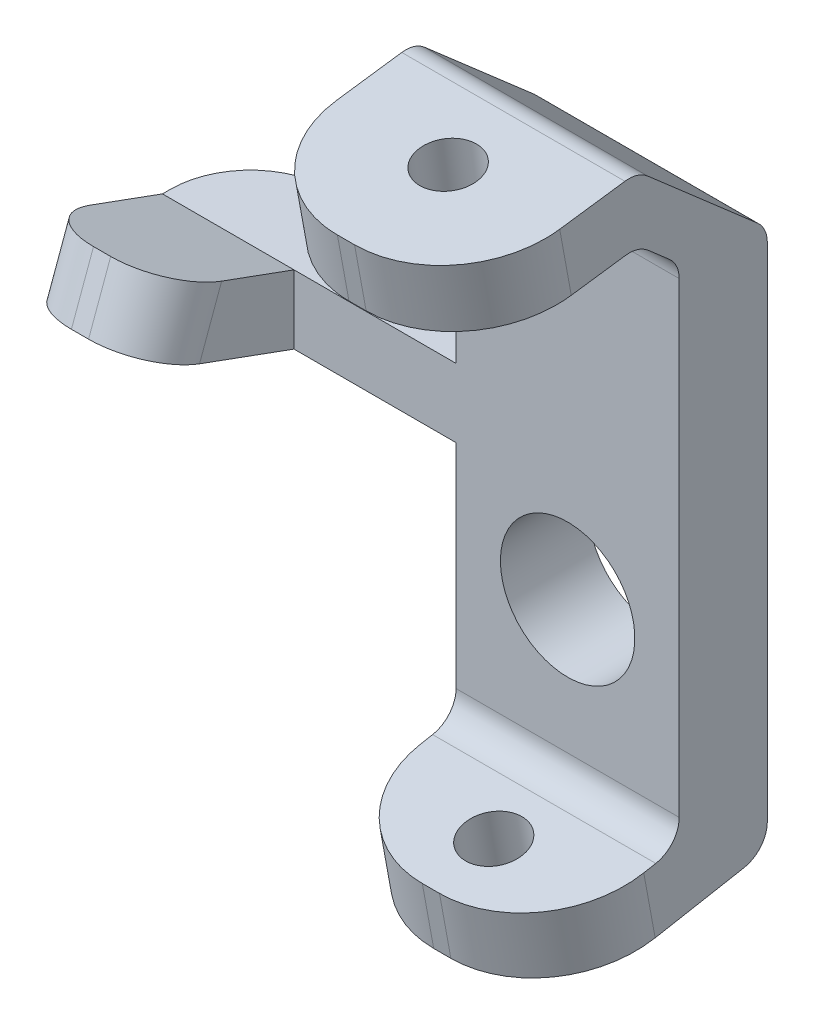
ISO-10303-21;
HEADER;
FILE_DESCRIPTION(('STEP AP214'),'2;1');
FILE_NAME('part.step','',(''),(''),'','','');
FILE_SCHEMA(('AUTOMOTIVE_DESIGN { 1 0 10303 214 1 1 1 1 }'));
ENDSEC;
DATA;
#1=APPLICATION_CONTEXT('core data for automotive mechanical design processes');
#2=APPLICATION_PROTOCOL_DEFINITION('international standard','automotive_design',2000,#1);
#3=PRODUCT_CONTEXT('',#1,'mechanical');
#4=PRODUCT('Part','Part','',(#3));
#5=PRODUCT_RELATED_PRODUCT_CATEGORY('part','',(#4));
#6=PRODUCT_DEFINITION_FORMATION('','',#4);
#7=PRODUCT_DEFINITION_CONTEXT('part definition',#1,'design');
#8=PRODUCT_DEFINITION('design','',#6,#7);
#9=PRODUCT_DEFINITION_SHAPE('','',#8);
#10=(LENGTH_UNIT() NAMED_UNIT(*) SI_UNIT(.MILLI.,.METRE.));
#11=(NAMED_UNIT(*) PLANE_ANGLE_UNIT() SI_UNIT($,.RADIAN.));
#12=(NAMED_UNIT(*) SI_UNIT($,.STERADIAN.) SOLID_ANGLE_UNIT());
#13=UNCERTAINTY_MEASURE_WITH_UNIT(LENGTH_MEASURE(1.E-05),#10,'distance_accuracy_value','');
#14=(GEOMETRIC_REPRESENTATION_CONTEXT(3) GLOBAL_UNCERTAINTY_ASSIGNED_CONTEXT((#13)) GLOBAL_UNIT_ASSIGNED_CONTEXT((#10,
#11,#12)) REPRESENTATION_CONTEXT('',''));
#15=CARTESIAN_POINT('',(0.,0.,0.));
#16=DIRECTION('',(0.,0.,1.));
#17=DIRECTION('',(1.,0.,0.));
#18=AXIS2_PLACEMENT_3D('',#15,#16,#17);
#19=CARTESIAN_POINT('',(-24.76754,83.0072,0.));
#20=DIRECTION('',(-1.,0.,0.));
#21=DIRECTION('',(0.,0.,1.));
#22=AXIS2_PLACEMENT_3D('',#19,#20,#21);
#23=PLANE('',#22);
#24=DIRECTION('',(0.,-0.18052784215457,0.983569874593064));
#25=VECTOR('',#24,1.);
#26=CARTESIAN_POINT('',(-24.76754,-45.4152,0.));
#27=LINE('',#26,#25);
#28=CARTESIAN_POINT('',(-24.76754,-46.370295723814,5.20364820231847));
#29=VERTEX_POINT('',#28);
#30=CARTESIAN_POINT('',(-24.76754,-49.9849511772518,24.8973761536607));
#31=VERTEX_POINT('',#30);
#32=EDGE_CURVE('E440',#29,#31,#27,.T.);
#33=ORIENTED_EDGE('',*,*,#32,.T.);
#34=DIRECTION('',(0.,0.983569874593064,0.18052784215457));
#35=VECTOR('',#34,1.);
#36=CARTESIAN_POINT('',(-24.76754,-36.2245156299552,27.4230144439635));
#37=LINE('',#36,#35);
#38=CARTESIAN_POINT('',(-24.76754,-36.2245156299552,27.4230144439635));
#39=VERTEX_POINT('',#38);
#40=EDGE_CURVE('E355',#31,#39,#37,.T.);
#41=ORIENTED_EDGE('',*,*,#40,.T.);
#42=DIRECTION('',(0.,-0.18052784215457,0.983569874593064));
#43=VECTOR('',#42,1.);
#44=CARTESIAN_POINT('',(-24.76754,-31.1912,0.));
#45=LINE('',#44,#43);
#46=CARTESIAN_POINT('',(-24.76754,-35.7360391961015,24.7616482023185));
#47=VERTEX_POINT('',#46);
#48=EDGE_CURVE('E437',#47,#39,#45,.T.);
#49=ORIENTED_EDGE('',*,*,#48,.F.);
#50=CARTESIAN_POINT('',(-24.76754,-29.4903704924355,25.908));
#51=DIRECTION('',(-1.,0.,0.));
#52=DIRECTION('',(0.,0.,1.));
#53=AXIS2_PLACEMENT_3D('',#50,#51,#52);
#54=CIRCLE('',#53,6.35);
#55=CARTESIAN_POINT('',(-24.76754,-29.4903704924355,19.558));
#56=VERTEX_POINT('',#55);
#57=EDGE_CURVE('E690',#47,#56,#54,.F.);
#58=ORIENTED_EDGE('',*,*,#57,.T.);
#59=DIRECTION('',(0.,-1.,0.));
#60=VECTOR('',#59,1.);
#61=CARTESIAN_POINT('',(-24.76754,83.0072,19.558));
#62=LINE('',#61,#60);
#63=CARTESIAN_POINT('',(-24.76754,17.78,19.558));
#64=VERTEX_POINT('',#63);
#65=EDGE_CURVE('E408',#64,#56,#62,.T.);
#66=ORIENTED_EDGE('',*,*,#65,.F.);
#67=DIRECTION('',(0.,0.,-1.));
#68=VECTOR('',#67,1.);
#69=CARTESIAN_POINT('',(-24.76754,17.78,0.));
#70=LINE('',#69,#68);
#71=CARTESIAN_POINT('',(-24.76754,17.78,0.));
#72=VERTEX_POINT('',#71);
#73=EDGE_CURVE('E275',#64,#72,#70,.T.);
#74=ORIENTED_EDGE('',*,*,#73,.T.);
#75=DIRECTION('',(0.,-1.,0.));
#76=VECTOR('',#75,1.);
#77=CARTESIAN_POINT('',(-24.76754,83.0072,0.));
#78=LINE('',#77,#76);
#79=CARTESIAN_POINT('',(-24.76754,-40.124627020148,0.));
#80=VERTEX_POINT('',#79);
#81=EDGE_CURVE('E387',#72,#80,#78,.T.);
#82=ORIENTED_EDGE('',*,*,#81,.T.);
#83=CARTESIAN_POINT('',(-24.76754,-40.124627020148,6.35));
#84=DIRECTION('',(-1.,0.,0.));
#85=DIRECTION('',(0.,0.,1.));
#86=AXIS2_PLACEMENT_3D('',#83,#84,#85);
#87=CIRCLE('',#86,6.35);
#88=EDGE_CURVE('E596',#80,#29,#87,.T.);
#89=ORIENTED_EDGE('',*,*,#88,.T.);
#90=EDGE_LOOP('',(#33,#41,#49,#58,#66,#74,#82,#89));
#91=FACE_BOUND('',#90,.T.);
#92=ADVANCED_FACE('F41',(#91),#23,.T.);
#93=CARTESIAN_POINT('',(-24.76754,71.2779299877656,0.));
#94=VERTEX_POINT('',#93);
#95=CARTESIAN_POINT('',(-24.76754,33.02,0.));
#96=VERTEX_POINT('',#95);
#97=EDGE_CURVE('E380',#94,#96,#78,.T.);
#98=ORIENTED_EDGE('',*,*,#97,.T.);
#99=DIRECTION('',(0.,0.,1.));
#100=VECTOR('',#99,1.);
#101=CARTESIAN_POINT('',(-24.76754,33.02,0.));
#102=LINE('',#101,#100);
#103=CARTESIAN_POINT('',(-24.76754,33.02,19.558));
#104=VERTEX_POINT('',#103);
#105=EDGE_CURVE('E373',#96,#104,#102,.T.);
#106=ORIENTED_EDGE('',*,*,#105,.T.);
#107=CARTESIAN_POINT('',(-24.76754,74.0894317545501,19.558));
#108=VERTEX_POINT('',#107);
#109=EDGE_CURVE('E391',#108,#104,#62,.T.);
#110=ORIENTED_EDGE('',*,*,#109,.F.);
#111=CARTESIAN_POINT('',(-24.76754,74.0894317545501,25.908));
#112=DIRECTION('',(-1.,0.,0.));
#113=DIRECTION('',(0.,0.,1.));
#114=AXIS2_PLACEMENT_3D('',#111,#112,#113);
#115=CIRCLE('',#114,6.35);
#116=CARTESIAN_POINT('',(-24.76754,78.8777147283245,21.7372870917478));
#117=VERTEX_POINT('',#116);
#118=EDGE_CURVE('E598',#108,#117,#115,.F.);
#119=ORIENTED_EDGE('',*,*,#118,.T.);
#120=DIRECTION('',(0.,-0.656805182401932,-0.754060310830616));
#121=VECTOR('',#120,1.);
#122=CARTESIAN_POINT('',(-24.76754,84.9884,28.7528));
#123=LINE('',#122,#121);
#124=CARTESIAN_POINT('',(-24.76754,82.9941677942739,26.4632758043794));
#125=VERTEX_POINT('',#124);
#126=EDGE_CURVE('E330',#125,#117,#123,.T.);
#127=ORIENTED_EDGE('',*,*,#126,.F.);
#128=CARTESIAN_POINT('',(-24.76754,78.2058848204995,30.6339887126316));
#129=DIRECTION('',(-1.,0.,0.));
#130=DIRECTION('',(0.,0.,1.));
#131=AXIS2_PLACEMENT_3D('',#128,#129,#130);
#132=CIRCLE('',#131,6.35);
#133=CARTESIAN_POINT('',(-24.76754,84.4975347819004,31.4928488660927));
#134=VERTEX_POINT('',#133);
#135=EDGE_CURVE('E317',#125,#134,#132,.F.);
#136=ORIENTED_EDGE('',*,*,#135,.T.);
#137=DIRECTION('',(0.,-0.135253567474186,0.990811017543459));
#138=VECTOR('',#137,1.);
#139=CARTESIAN_POINT('',(-24.76754,85.2221021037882,26.1849719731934));
#140=LINE('',#139,#138);
#141=CARTESIAN_POINT('',(-24.76754,82.856251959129,43.5161997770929));
#142=VERTEX_POINT('',#141);
#143=EDGE_CURVE('E260',#134,#142,#140,.T.);
#144=ORIENTED_EDGE('',*,*,#143,.T.);
#145=DIRECTION('',(0.,-0.983569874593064,-0.18052784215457));
#146=VECTOR('',#145,1.);
#147=CARTESIAN_POINT('',(-24.76754,97.8782664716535,46.2733926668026));
#148=LINE('',#147,#146);
#149=CARTESIAN_POINT('',(-24.76754,96.8465498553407,46.0840278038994));
#150=VERTEX_POINT('',#149);
#151=EDGE_CURVE('E379',#142,#150,#148,.F.);
#152=ORIENTED_EDGE('',*,*,#151,.T.);
#153=DIRECTION('',(0.,-0.135253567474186,0.990811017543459));
#154=VECTOR('',#153,1.);
#155=CARTESIAN_POINT('',(-24.76754,99.2124,28.7528));
#156=LINE('',#155,#154);
#157=CARTESIAN_POINT('',(-24.76754,98.8225330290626,31.6088022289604));
#158=VERTEX_POINT('',#157);
#159=EDGE_CURVE('E312',#158,#150,#156,.T.);
#160=ORIENTED_EDGE('',*,*,#159,.F.);
#161=CARTESIAN_POINT('',(-24.76754,92.5308830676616,30.7499420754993));
#162=DIRECTION('',(-1.,0.,0.));
#163=DIRECTION('',(0.,0.,1.));
#164=AXIS2_PLACEMENT_3D('',#161,#162,#163);
#165=CIRCLE('',#164,6.35);
#166=CARTESIAN_POINT('',(-24.76754,97.319166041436,26.579229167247));
#167=VERTEX_POINT('',#166);
#168=EDGE_CURVE('E327',#158,#167,#165,.T.);
#169=ORIENTED_EDGE('',*,*,#168,.T.);
#170=DIRECTION('',(0.,-0.656805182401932,-0.754060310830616));
#171=VECTOR('',#170,1.);
#172=CARTESIAN_POINT('',(-24.76754,99.2124,28.7528));
#173=LINE('',#172,#171);
#174=CARTESIAN_POINT('',(-24.76754,76.06621296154,2.17928709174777));
#175=VERTEX_POINT('',#174);
#176=EDGE_CURVE('E322',#167,#175,#173,.T.);
#177=ORIENTED_EDGE('',*,*,#176,.T.);
#178=CARTESIAN_POINT('',(-24.76754,71.2779299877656,6.35));
#179=DIRECTION('',(-1.,0.,0.));
#180=DIRECTION('',(0.,0.,1.));
#181=AXIS2_PLACEMENT_3D('',#178,#179,#180);
#182=CIRCLE('',#181,6.35);
#183=EDGE_CURVE('E383',#175,#94,#182,.T.);
#184=ORIENTED_EDGE('',*,*,#183,.T.);
#185=EDGE_LOOP('',(#98,#106,#110,#119,#127,#136,#144,#152,#160,#169,#177,#184));
#186=FACE_BOUND('',#185,.T.);
#187=ADVANCED_FACE('F381',(#186),#23,.T.);
#188=CARTESIAN_POINT('',(0.,34.0845751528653,-29.6885080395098));
#189=DIRECTION('',(0.,0.754060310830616,-0.656805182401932));
#190=DIRECTION('',(0.,0.656805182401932,0.754060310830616));
#191=AXIS2_PLACEMENT_3D('',#188,#189,#190);
#192=PLANE('',#191);
#193=DIRECTION('',(0.,-0.656805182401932,-0.754060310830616));
#194=VECTOR('',#193,1.);
#195=CARTESIAN_POINT('',(24.76754,84.9884,28.7528));
#196=LINE('',#195,#194);
#197=CARTESIAN_POINT('',(24.76754,82.9941677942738,26.4632758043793));
#198=VERTEX_POINT('',#197);
#199=CARTESIAN_POINT('',(24.76754,78.8777147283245,21.7372870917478));
#200=VERTEX_POINT('',#199);
#201=EDGE_CURVE('E441',#198,#200,#196,.T.);
#202=ORIENTED_EDGE('',*,*,#201,.F.);
#203=DIRECTION('',(1.,0.,0.));
#204=VECTOR('',#203,1.);
#205=CARTESIAN_POINT('',(-24.76754,82.9941677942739,26.4632758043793));
#206=LINE('',#205,#204);
#207=EDGE_CURVE('E636',#198,#125,#206,.F.);
#208=ORIENTED_EDGE('',*,*,#207,.T.);
#209=ORIENTED_EDGE('',*,*,#126,.T.);
#210=DIRECTION('',(1.,0.,0.));
#211=VECTOR('',#210,1.);
#212=CARTESIAN_POINT('',(24.76754,78.8777147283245,21.7372870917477));
#213=LINE('',#212,#211);
#214=EDGE_CURVE('E605',#117,#200,#213,.T.);
#215=ORIENTED_EDGE('',*,*,#214,.T.);
#216=EDGE_LOOP('',(#202,#208,#209,#215));
#217=FACE_BOUND('',#216,.T.);
#218=ADVANCED_FACE('F454',(#217),#192,.F.);
#219=CARTESIAN_POINT('',(0.,0.,19.558));
#220=DIRECTION('',(0.,0.,-1.));
#221=DIRECTION('',(-1.,0.,0.));
#222=AXIS2_PLACEMENT_3D('',#219,#220,#221);
#223=PLANE('',#222);
#224=DIRECTION('',(1.,0.,0.));
#225=VECTOR('',#224,1.);
#226=CARTESIAN_POINT('',(-89.9414,33.02,19.558));
#227=LINE('',#226,#225);
#228=CARTESIAN_POINT('',(-60.7314,33.02,19.558));
#229=VERTEX_POINT('',#228);
#230=EDGE_CURVE('E258',#229,#104,#227,.T.);
#231=ORIENTED_EDGE('',*,*,#230,.F.);
#232=DIRECTION('',(0.,1.,0.));
#233=VECTOR('',#232,1.);
#234=CARTESIAN_POINT('',(-60.7314,33.02,19.558));
#235=LINE('',#234,#233);
#236=CARTESIAN_POINT('',(-60.7314,17.78,19.558));
#237=VERTEX_POINT('',#236);
#238=EDGE_CURVE('E291',#237,#229,#235,.T.);
#239=ORIENTED_EDGE('',*,*,#238,.F.);
#240=DIRECTION('',(-1.,0.,0.));
#241=VECTOR('',#240,1.);
#242=CARTESIAN_POINT('',(0.,17.78,19.558));
#243=LINE('',#242,#241);
#244=EDGE_CURVE('E240',#64,#237,#243,.T.);
#245=ORIENTED_EDGE('',*,*,#244,.F.);
#246=ORIENTED_EDGE('',*,*,#65,.T.);
#247=DIRECTION('',(1.,0.,0.));
#248=VECTOR('',#247,1.);
#249=CARTESIAN_POINT('',(0.,-29.4903704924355,19.558));
#250=LINE('',#249,#248);
#251=CARTESIAN_POINT('',(24.76754,-29.4903704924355,19.558));
#252=VERTEX_POINT('',#251);
#253=EDGE_CURVE('E434',#56,#252,#250,.T.);
#254=ORIENTED_EDGE('',*,*,#253,.T.);
#255=DIRECTION('',(0.,1.,0.));
#256=VECTOR('',#255,1.);
#257=CARTESIAN_POINT('',(24.76754,83.0072,19.558));
#258=LINE('',#257,#256);
#259=CARTESIAN_POINT('',(24.76754,74.0894317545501,19.558));
#260=VERTEX_POINT('',#259);
#261=EDGE_CURVE('E416',#252,#260,#258,.T.);
#262=ORIENTED_EDGE('',*,*,#261,.T.);
#263=DIRECTION('',(1.,0.,0.));
#264=VECTOR('',#263,1.);
#265=CARTESIAN_POINT('',(-24.76754,74.0894317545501,19.558));
#266=LINE('',#265,#264);
#267=EDGE_CURVE('E604',#260,#108,#266,.F.);
#268=ORIENTED_EDGE('',*,*,#267,.T.);
#269=ORIENTED_EDGE('',*,*,#109,.T.);
#270=EDGE_LOOP('',(#231,#239,#245,#246,#254,#262,#268,#269));
#271=FACE_BOUND('',#270,.T.);
#272=CARTESIAN_POINT('',(0.,0.,19.558));
#273=DIRECTION('',(0.,0.,-1.));
#274=DIRECTION('',(-1.,0.,0.));
#275=AXIS2_PLACEMENT_3D('',#272,#273,#274);
#276=CIRCLE('',#275,14.9225);
#277=CARTESIAN_POINT('',(-14.9225,0.,19.558));
#278=VERTEX_POINT('',#277);
#279=EDGE_CURVE('E400',#278,#278,#276,.F.);
#280=ORIENTED_EDGE('',*,*,#279,.F.);
#281=EDGE_LOOP('',(#280));
#282=FACE_BOUND('',#281,.T.);
#283=ADVANCED_FACE('F452',(#271,#282),#223,.F.);
#284=CARTESIAN_POINT('',(0.,0.,0.));
#285=DIRECTION('',(0.,0.,-1.));
#286=DIRECTION('',(-1.,0.,0.));
#287=AXIS2_PLACEMENT_3D('',#284,#285,#286);
#288=PLANE('',#287);
#289=DIRECTION('',(-1.,0.,0.));
#290=VECTOR('',#289,1.);
#291=CARTESIAN_POINT('',(0.,17.78,0.));
#292=LINE('',#291,#290);
#293=CARTESIAN_POINT('',(-72.1614,17.78,0.));
#294=VERTEX_POINT('',#293);
#295=EDGE_CURVE('E262',#72,#294,#292,.T.);
#296=ORIENTED_EDGE('',*,*,#295,.T.);
#297=DIRECTION('',(0.,1.,0.));
#298=VECTOR('',#297,1.);
#299=CARTESIAN_POINT('',(-72.1614,33.02,0.));
#300=LINE('',#299,#298);
#301=CARTESIAN_POINT('',(-72.1614,33.02,0.));
#302=VERTEX_POINT('',#301);
#303=EDGE_CURVE('E296',#294,#302,#300,.T.);
#304=ORIENTED_EDGE('',*,*,#303,.T.);
#305=DIRECTION('',(1.,0.,0.));
#306=VECTOR('',#305,1.);
#307=CARTESIAN_POINT('',(-89.9414,33.02,0.));
#308=LINE('',#307,#306);
#309=EDGE_CURVE('E257',#302,#96,#308,.T.);
#310=ORIENTED_EDGE('',*,*,#309,.T.);
#311=ORIENTED_EDGE('',*,*,#97,.F.);
#312=DIRECTION('',(-1.,0.,0.));
#313=VECTOR('',#312,1.);
#314=CARTESIAN_POINT('',(0.,71.2779299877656,0.));
#315=LINE('',#314,#313);
#316=CARTESIAN_POINT('',(24.76754,71.2779299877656,0.));
#317=VERTEX_POINT('',#316);
#318=EDGE_CURVE('E610',#94,#317,#315,.F.);
#319=ORIENTED_EDGE('',*,*,#318,.T.);
#320=DIRECTION('',(0.,1.,0.));
#321=VECTOR('',#320,1.);
#322=CARTESIAN_POINT('',(24.76754,83.0072,0.));
#323=LINE('',#322,#321);
#324=CARTESIAN_POINT('',(24.76754,-40.124627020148,0.));
#325=VERTEX_POINT('',#324);
#326=EDGE_CURVE('E409',#325,#317,#323,.T.);
#327=ORIENTED_EDGE('',*,*,#326,.F.);
#328=DIRECTION('',(1.,0.,0.));
#329=VECTOR('',#328,1.);
#330=CARTESIAN_POINT('',(-24.76754,-40.124627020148,0.));
#331=LINE('',#330,#329);
#332=EDGE_CURVE('E655',#325,#80,#331,.F.);
#333=ORIENTED_EDGE('',*,*,#332,.T.);
#334=ORIENTED_EDGE('',*,*,#81,.F.);
#335=EDGE_LOOP('',(#296,#304,#310,#311,#319,#327,#333,#334));
#336=FACE_BOUND('',#335,.T.);
#337=CARTESIAN_POINT('',(0.,0.,0.));
#338=DIRECTION('',(0.,0.,1.));
#339=DIRECTION('',(1.,0.,0.));
#340=AXIS2_PLACEMENT_3D('',#337,#338,#339);
#341=CIRCLE('',#340,14.9225);
#342=CARTESIAN_POINT('',(14.9225,0.,0.));
#343=VERTEX_POINT('',#342);
#344=EDGE_CURVE('E345',#343,#343,#341,.T.);
#345=ORIENTED_EDGE('',*,*,#344,.T.);
#346=EDGE_LOOP('',(#345));
#347=FACE_BOUND('',#346,.T.);
#348=ADVANCED_FACE('F365',(#336,#347),#288,.T.);
#349=CARTESIAN_POINT('',(24.76754,83.0072,0.));
#350=DIRECTION('',(1.,0.,0.));
#351=DIRECTION('',(0.,0.,-1.));
#352=AXIS2_PLACEMENT_3D('',#349,#350,#351);
#353=PLANE('',#352);
#354=DIRECTION('',(0.,0.18052784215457,-0.983569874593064));
#355=VECTOR('',#354,1.);
#356=CARTESIAN_POINT('',(24.76754,-39.1175414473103,43.1850875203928));
#357=LINE('',#356,#355);
#358=CARTESIAN_POINT('',(24.76754,-36.2245156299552,27.4230144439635));
#359=VERTEX_POINT('',#358);
#360=CARTESIAN_POINT('',(24.76754,-35.7360391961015,24.7616482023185));
#361=VERTEX_POINT('',#360);
#362=EDGE_CURVE('E346',#359,#361,#357,.T.);
#363=ORIENTED_EDGE('',*,*,#362,.F.);
#364=DIRECTION('',(0.,0.983569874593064,0.18052784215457));
#365=VECTOR('',#364,1.);
#366=CARTESIAN_POINT('',(24.76754,-49.9849511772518,24.8973761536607));
#367=LINE('',#366,#365);
#368=CARTESIAN_POINT('',(24.76754,-49.9849511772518,24.8973761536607));
#369=VERTEX_POINT('',#368);
#370=EDGE_CURVE('E349',#359,#369,#367,.F.);
#371=ORIENTED_EDGE('',*,*,#370,.T.);
#372=DIRECTION('',(0.,0.18052784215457,-0.983569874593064));
#373=VECTOR('',#372,1.);
#374=CARTESIAN_POINT('',(24.76754,-53.3415414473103,43.1850875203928));
#375=LINE('',#374,#373);
#376=CARTESIAN_POINT('',(24.76754,-46.370295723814,5.20364820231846));
#377=VERTEX_POINT('',#376);
#378=EDGE_CURVE('E342',#369,#377,#375,.T.);
#379=ORIENTED_EDGE('',*,*,#378,.T.);
#380=CARTESIAN_POINT('',(24.76754,-40.124627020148,6.35));
#381=DIRECTION('',(1.,0.,0.));
#382=DIRECTION('',(0.,0.,-1.));
#383=AXIS2_PLACEMENT_3D('',#380,#381,#382);
#384=CIRCLE('',#383,6.35);
#385=EDGE_CURVE('E426',#377,#325,#384,.T.);
#386=ORIENTED_EDGE('',*,*,#385,.T.);
#387=ORIENTED_EDGE('',*,*,#326,.T.);
#388=CARTESIAN_POINT('',(24.76754,71.2779299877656,6.35));
#389=DIRECTION('',(1.,0.,0.));
#390=DIRECTION('',(0.,0.,-1.));
#391=AXIS2_PLACEMENT_3D('',#388,#389,#390);
#392=CIRCLE('',#391,6.35);
#393=CARTESIAN_POINT('',(24.76754,76.06621296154,2.17928709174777));
#394=VERTEX_POINT('',#393);
#395=EDGE_CURVE('E609',#317,#394,#392,.T.);
#396=ORIENTED_EDGE('',*,*,#395,.T.);
#397=DIRECTION('',(0.,-0.656805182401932,-0.754060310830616));
#398=VECTOR('',#397,1.);
#399=CARTESIAN_POINT('',(24.76754,99.2124,28.7528));
#400=LINE('',#399,#398);
#401=CARTESIAN_POINT('',(24.76754,97.319166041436,26.579229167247));
#402=VERTEX_POINT('',#401);
#403=EDGE_CURVE('E617',#402,#394,#400,.T.);
#404=ORIENTED_EDGE('',*,*,#403,.F.);
#405=CARTESIAN_POINT('',(24.76754,92.5308830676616,30.7499420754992));
#406=DIRECTION('',(1.,0.,0.));
#407=DIRECTION('',(0.,0.,-1.));
#408=AXIS2_PLACEMENT_3D('',#405,#406,#407);
#409=CIRCLE('',#408,6.35);
#410=CARTESIAN_POINT('',(24.76754,98.8225330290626,31.6088022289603));
#411=VERTEX_POINT('',#410);
#412=EDGE_CURVE('E432',#402,#411,#409,.T.);
#413=ORIENTED_EDGE('',*,*,#412,.T.);
#414=DIRECTION('',(0.,-0.135253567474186,0.99081101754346));
#415=VECTOR('',#414,1.);
#416=CARTESIAN_POINT('',(24.76754,99.2124,28.7528));
#417=LINE('',#416,#415);
#418=CARTESIAN_POINT('',(24.76754,96.8465498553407,46.0840278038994));
#419=VERTEX_POINT('',#418);
#420=EDGE_CURVE('E319',#411,#419,#417,.T.);
#421=ORIENTED_EDGE('',*,*,#420,.T.);
#422=DIRECTION('',(0.,-0.983569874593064,-0.18052784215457));
#423=VECTOR('',#422,1.);
#424=CARTESIAN_POINT('',(24.76754,83.8879685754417,43.705564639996));
#425=LINE('',#424,#423);
#426=CARTESIAN_POINT('',(24.76754,82.856251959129,43.5161997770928));
#427=VERTEX_POINT('',#426);
#428=EDGE_CURVE('E687',#419,#427,#425,.T.);
#429=ORIENTED_EDGE('',*,*,#428,.T.);
#430=DIRECTION('',(0.,-0.135253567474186,0.99081101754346));
#431=VECTOR('',#430,1.);
#432=CARTESIAN_POINT('',(24.76754,85.2221021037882,26.1849719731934));
#433=LINE('',#432,#431);
#434=CARTESIAN_POINT('',(24.76754,84.4975347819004,31.4928488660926));
#435=VERTEX_POINT('',#434);
#436=EDGE_CURVE('E323',#435,#427,#433,.T.);
#437=ORIENTED_EDGE('',*,*,#436,.F.);
#438=CARTESIAN_POINT('',(24.76754,78.2058848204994,30.6339887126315));
#439=DIRECTION('',(1.,0.,0.));
#440=DIRECTION('',(0.,0.,-1.));
#441=AXIS2_PLACEMENT_3D('',#438,#439,#440);
#442=CIRCLE('',#441,6.35);
#443=EDGE_CURVE('E637',#435,#198,#442,.F.);
#444=ORIENTED_EDGE('',*,*,#443,.T.);
#445=ORIENTED_EDGE('',*,*,#201,.T.);
#446=CARTESIAN_POINT('',(24.76754,74.0894317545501,25.908));
#447=DIRECTION('',(1.,0.,0.));
#448=DIRECTION('',(0.,0.,-1.));
#449=AXIS2_PLACEMENT_3D('',#446,#447,#448);
#450=CIRCLE('',#449,6.35);
#451=EDGE_CURVE('E601',#200,#260,#450,.F.);
#452=ORIENTED_EDGE('',*,*,#451,.T.);
#453=ORIENTED_EDGE('',*,*,#261,.F.);
#454=CARTESIAN_POINT('',(24.76754,-29.4903704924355,25.908));
#455=DIRECTION('',(1.,0.,0.));
#456=DIRECTION('',(0.,0.,-1.));
#457=AXIS2_PLACEMENT_3D('',#454,#455,#456);
#458=CIRCLE('',#457,6.35);
#459=EDGE_CURVE('E583',#252,#361,#458,.F.);
#460=ORIENTED_EDGE('',*,*,#459,.T.);
#461=EDGE_LOOP('',(#363,#371,#379,#386,#387,#396,#404,#413,#421,#429,#437,#444,#445,#452,#453,#460));
#462=FACE_BOUND('',#461,.T.);
#463=ADVANCED_FACE('F461',(#462),#353,.T.);
#464=CARTESIAN_POINT('',(0.,0.,19.5581030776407));
#465=DIRECTION('',(0.,0.,-1.));
#466=DIRECTION('',(-1.,0.,0.));
#467=AXIS2_PLACEMENT_3D('',#464,#465,#466);
#468=CYLINDRICAL_SURFACE('',#467,14.9225);
#469=ORIENTED_EDGE('',*,*,#344,.F.);
#470=EDGE_LOOP('',(#469));
#471=FACE_BOUND('',#470,.T.);
#472=ORIENTED_EDGE('',*,*,#279,.T.);
#473=EDGE_LOOP('',(#472));
#474=FACE_BOUND('',#473,.T.);
#475=ADVANCED_FACE('F450',(#471,#474),#468,.F.);
#476=CARTESIAN_POINT('',(0.,-29.7111049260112,-8.06400225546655));
#477=DIRECTION('',(0.,0.983569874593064,0.18052784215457));
#478=DIRECTION('',(0.,-0.18052784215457,0.983569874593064));
#479=AXIS2_PLACEMENT_3D('',#476,#477,#478);
#480=PLANE('',#479);
#481=CARTESIAN_POINT('',(0.,-37.7897743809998,35.9510139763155));
#482=DIRECTION('',(0.,0.983569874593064,0.18052784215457));
#483=DIRECTION('',(0.,-0.18052784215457,0.983569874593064));
#484=AXIS2_PLACEMENT_3D('',#481,#482,#483);
#485=CIRCLE('',#484,6.35);
#486=CARTESIAN_POINT('',(0.,-38.9361261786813,42.1966826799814));
#487=VERTEX_POINT('',#486);
#488=EDGE_CURVE('E546',#487,#487,#485,.T.);
#489=ORIENTED_EDGE('',*,*,#488,.F.);
#490=EDGE_LOOP('',(#489));
#491=FACE_BOUND('',#490,.T.);
#492=DIRECTION('',(1.,0.,0.));
#493=VECTOR('',#492,1.);
#494=CARTESIAN_POINT('',(-24.76754,-40.3513821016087,49.9074217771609));
#495=LINE('',#494,#493);
#496=CARTESIAN_POINT('',(-1.90754000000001,-40.3513821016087,49.9074217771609));
#497=VERTEX_POINT('',#496);
#498=CARTESIAN_POINT('',(1.90753999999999,-40.3513821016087,49.9074217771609));
#499=VERTEX_POINT('',#498);
#500=EDGE_CURVE('E557',#497,#499,#495,.T.);
#501=ORIENTED_EDGE('',*,*,#500,.T.);
#502=CARTESIAN_POINT('',(1.90753999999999,-36.2245156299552,27.4230144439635));
#503=DIRECTION('',(0.,0.983569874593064,0.18052784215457));
#504=DIRECTION('',(0.,-0.18052784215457,0.983569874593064));
#505=AXIS2_PLACEMENT_3D('',#502,#503,#504);
#506=CIRCLE('',#505,22.86);
#507=EDGE_CURVE('E347',#499,#359,#506,.T.);
#508=ORIENTED_EDGE('',*,*,#507,.T.);
#509=ORIENTED_EDGE('',*,*,#362,.T.);
#510=DIRECTION('',(1.,0.,0.));
#511=VECTOR('',#510,1.);
#512=CARTESIAN_POINT('',(0.,-35.7360391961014,24.7616482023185));
#513=LINE('',#512,#511);
#514=EDGE_CURVE('E436',#361,#47,#513,.F.);
#515=ORIENTED_EDGE('',*,*,#514,.T.);
#516=ORIENTED_EDGE('',*,*,#48,.T.);
#517=CARTESIAN_POINT('',(-1.90754000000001,-36.2245156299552,27.4230144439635));
#518=DIRECTION('',(0.,0.983569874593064,0.18052784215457));
#519=DIRECTION('',(0.,-0.18052784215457,0.983569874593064));
#520=AXIS2_PLACEMENT_3D('',#517,#518,#519);
#521=CIRCLE('',#520,22.86);
#522=EDGE_CURVE('E572',#39,#497,#521,.T.);
#523=ORIENTED_EDGE('',*,*,#522,.T.);
#524=EDGE_LOOP('',(#501,#508,#509,#515,#516,#523));
#525=FACE_BOUND('',#524,.T.);
#526=ADVANCED_FACE('F476',(#491,#525),#480,.T.);
#527=CARTESIAN_POINT('',(0.,-43.9351049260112,-8.06400225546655));
#528=DIRECTION('',(0.,0.983569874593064,0.18052784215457));
#529=DIRECTION('',(0.,-0.18052784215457,0.983569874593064));
#530=AXIS2_PLACEMENT_3D('',#527,#528,#529);
#531=PLANE('',#530);
#532=CARTESIAN_POINT('',(0.,-51.5502099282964,33.4253756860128));
#533=DIRECTION('',(0.,0.983569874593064,0.18052784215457));
#534=DIRECTION('',(0.,-0.18052784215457,0.983569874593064));
#535=AXIS2_PLACEMENT_3D('',#532,#533,#534);
#536=CIRCLE('',#535,6.35);
#537=CARTESIAN_POINT('',(0.,-52.6965617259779,39.6710443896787));
#538=VERTEX_POINT('',#537);
#539=EDGE_CURVE('E45',#538,#538,#536,.T.);
#540=ORIENTED_EDGE('',*,*,#539,.T.);
#541=EDGE_LOOP('',(#540));
#542=FACE_BOUND('',#541,.T.);
#543=ORIENTED_EDGE('',*,*,#378,.F.);
#544=CARTESIAN_POINT('',(1.90753999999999,-49.9849511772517,24.8973761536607));
#545=DIRECTION('',(0.,0.983569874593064,0.18052784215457));
#546=DIRECTION('',(0.,-0.18052784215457,0.983569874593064));
#547=AXIS2_PLACEMENT_3D('',#544,#545,#546);
#548=CIRCLE('',#547,22.86);
#549=CARTESIAN_POINT('',(1.90753999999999,-54.1118176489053,47.3817834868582));
#550=VERTEX_POINT('',#549);
#551=EDGE_CURVE('E353',#369,#550,#548,.F.);
#552=ORIENTED_EDGE('',*,*,#551,.T.);
#553=DIRECTION('',(1.,0.,0.));
#554=VECTOR('',#553,1.);
#555=CARTESIAN_POINT('',(-24.76754,-54.1118176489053,47.3817834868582));
#556=LINE('',#555,#554);
#557=CARTESIAN_POINT('',(-1.90754000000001,-54.1118176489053,47.3817834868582));
#558=VERTEX_POINT('',#557);
#559=EDGE_CURVE('E562',#558,#550,#556,.T.);
#560=ORIENTED_EDGE('',*,*,#559,.F.);
#561=CARTESIAN_POINT('',(-1.90754000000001,-49.9849511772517,24.8973761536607));
#562=DIRECTION('',(0.,0.983569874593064,0.18052784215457));
#563=DIRECTION('',(0.,-0.18052784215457,0.983569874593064));
#564=AXIS2_PLACEMENT_3D('',#561,#562,#563);
#565=CIRCLE('',#564,22.86);
#566=EDGE_CURVE('E351',#558,#31,#565,.F.);
#567=ORIENTED_EDGE('',*,*,#566,.T.);
#568=ORIENTED_EDGE('',*,*,#32,.F.);
#569=DIRECTION('',(1.,0.,0.));
#570=VECTOR('',#569,1.);
#571=CARTESIAN_POINT('',(24.76754,-46.3702957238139,5.20364820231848));
#572=LINE('',#571,#570);
#573=EDGE_CURVE('E424',#29,#377,#572,.T.);
#574=ORIENTED_EDGE('',*,*,#573,.T.);
#575=EDGE_LOOP('',(#543,#552,#560,#567,#568,#574));
#576=FACE_BOUND('',#575,.T.);
#577=ADVANCED_FACE('F480',(#542,#576),#531,.F.);
#578=CARTESIAN_POINT('',(0.,48.3085751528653,-29.6885080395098));
#579=DIRECTION('',(0.,0.754060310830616,-0.656805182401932));
#580=DIRECTION('',(0.,0.656805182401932,0.754060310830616));
#581=AXIS2_PLACEMENT_3D('',#578,#579,#580);
#582=PLANE('',#581);
#583=ORIENTED_EDGE('',*,*,#176,.F.);
#584=DIRECTION('',(-1.,0.,0.));
#585=VECTOR('',#584,1.);
#586=CARTESIAN_POINT('',(1.61248788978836E-13,97.319166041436,26.579229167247));
#587=LINE('',#586,#585);
#588=EDGE_CURVE('E624',#167,#402,#587,.F.);
#589=ORIENTED_EDGE('',*,*,#588,.T.);
#590=ORIENTED_EDGE('',*,*,#403,.T.);
#591=DIRECTION('',(-1.,0.,0.));
#592=VECTOR('',#591,1.);
#593=CARTESIAN_POINT('',(0.,76.0662129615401,2.17928709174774));
#594=LINE('',#593,#592);
#595=EDGE_CURVE('E386',#394,#175,#594,.T.);
#596=ORIENTED_EDGE('',*,*,#595,.T.);
#597=EDGE_LOOP('',(#583,#589,#590,#596));
#598=FACE_BOUND('',#597,.T.);
#599=ADVANCED_FACE('F484',(#598),#582,.T.);
#600=CARTESIAN_POINT('',(0.,71.2779299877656,6.35));
#601=DIRECTION('',(-1.,0.,0.));
#602=DIRECTION('',(0.,-1.,0.));
#603=AXIS2_PLACEMENT_3D('',#600,#601,#602);
#604=CYLINDRICAL_SURFACE('',#603,6.35);
#605=ORIENTED_EDGE('',*,*,#395,.F.);
#606=ORIENTED_EDGE('',*,*,#318,.F.);
#607=ORIENTED_EDGE('',*,*,#183,.F.);
#608=ORIENTED_EDGE('',*,*,#595,.F.);
#609=EDGE_LOOP('',(#605,#606,#607,#608));
#610=FACE_BOUND('',#609,.T.);
#611=ADVANCED_FACE('F487',(#610),#604,.T.);
#612=CARTESIAN_POINT('',(0.,74.0894317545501,25.908));
#613=DIRECTION('',(-1.,0.,0.));
#614=DIRECTION('',(0.,-1.,0.));
#615=AXIS2_PLACEMENT_3D('',#612,#613,#614);
#616=CYLINDRICAL_SURFACE('',#615,6.35);
#617=ORIENTED_EDGE('',*,*,#118,.F.);
#618=ORIENTED_EDGE('',*,*,#267,.F.);
#619=ORIENTED_EDGE('',*,*,#451,.F.);
#620=ORIENTED_EDGE('',*,*,#214,.F.);
#621=EDGE_LOOP('',(#617,#618,#619,#620));
#622=FACE_BOUND('',#621,.T.);
#623=ADVANCED_FACE('F701',(#622),#616,.F.);
#624=CARTESIAN_POINT('',(0.,-40.124627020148,6.35));
#625=DIRECTION('',(-1.,0.,0.));
#626=DIRECTION('',(0.,-1.,0.));
#627=AXIS2_PLACEMENT_3D('',#624,#625,#626);
#628=CYLINDRICAL_SURFACE('',#627,6.35);
#629=ORIENTED_EDGE('',*,*,#88,.F.);
#630=ORIENTED_EDGE('',*,*,#332,.F.);
#631=ORIENTED_EDGE('',*,*,#385,.F.);
#632=ORIENTED_EDGE('',*,*,#573,.F.);
#633=EDGE_LOOP('',(#629,#630,#631,#632));
#634=FACE_BOUND('',#633,.T.);
#635=ADVANCED_FACE('F494',(#634),#628,.T.);
#636=CARTESIAN_POINT('',(1.64112505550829E-13,87.2603409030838,11.2536877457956));
#637=DIRECTION('',(0.,0.99081101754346,0.135253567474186));
#638=DIRECTION('',(0.,-0.135253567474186,0.99081101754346));
#639=AXIS2_PLACEMENT_3D('',#636,#637,#638);
#640=PLANE('',#639);
#641=CARTESIAN_POINT('',(0.,82.7680673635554,44.1622032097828));
#642=DIRECTION('',(0.,0.99081101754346,0.135253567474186));
#643=DIRECTION('',(0.,-0.135253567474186,0.99081101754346));
#644=AXIS2_PLACEMENT_3D('',#641,#642,#643);
#645=CIRCLE('',#644,6.35);
#646=CARTESIAN_POINT('',(0.,81.9092072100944,50.4538531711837));
#647=VERTEX_POINT('',#646);
#648=EDGE_CURVE('E551',#647,#647,#645,.T.);
#649=ORIENTED_EDGE('',*,*,#648,.T.);
#650=EDGE_LOOP('',(#649));
#651=FACE_BOUND('',#650,.T.);
#652=ORIENTED_EDGE('',*,*,#436,.T.);
#653=CARTESIAN_POINT('',(1.90753999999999,82.856251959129,43.5161997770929));
#654=DIRECTION('',(0.,0.99081101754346,0.135253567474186));
#655=DIRECTION('',(0.,-0.135253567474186,0.99081101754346));
#656=AXIS2_PLACEMENT_3D('',#653,#654,#655);
#657=ELLIPSE('',#656,22.884053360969,22.86);
#658=CARTESIAN_POINT('',(1.90753999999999,79.7611021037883,66.1899719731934));
#659=VERTEX_POINT('',#658);
#660=EDGE_CURVE('E667',#427,#659,#657,.F.);
#661=ORIENTED_EDGE('',*,*,#660,.T.);
#662=DIRECTION('',(1.,0.,0.));
#663=VECTOR('',#662,1.);
#664=CARTESIAN_POINT('',(-24.76754,79.7611021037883,66.1899719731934));
#665=LINE('',#664,#663);
#666=CARTESIAN_POINT('',(-1.90754000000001,79.7611021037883,66.1899719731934));
#667=VERTEX_POINT('',#666);
#668=EDGE_CURVE('E316',#667,#659,#665,.T.);
#669=ORIENTED_EDGE('',*,*,#668,.F.);
#670=CARTESIAN_POINT('',(-1.90754000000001,82.856251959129,43.5161997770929));
#671=DIRECTION('',(0.,0.99081101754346,0.135253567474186));
#672=DIRECTION('',(0.,-0.135253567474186,0.99081101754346));
#673=AXIS2_PLACEMENT_3D('',#670,#671,#672);
#674=ELLIPSE('',#673,22.884053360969,22.86);
#675=EDGE_CURVE('E653',#667,#142,#674,.F.);
#676=ORIENTED_EDGE('',*,*,#675,.T.);
#677=ORIENTED_EDGE('',*,*,#143,.F.);
#678=DIRECTION('',(1.,0.,0.));
#679=VECTOR('',#678,1.);
#680=CARTESIAN_POINT('',(24.76754,84.4975347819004,31.4928488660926));
#681=LINE('',#680,#679);
#682=EDGE_CURVE('E638',#134,#435,#681,.T.);
#683=ORIENTED_EDGE('',*,*,#682,.T.);
#684=EDGE_LOOP('',(#652,#661,#669,#676,#677,#683));
#685=FACE_BOUND('',#684,.T.);
#686=ADVANCED_FACE('F490',(#651,#685),#640,.F.);
#687=CARTESIAN_POINT('',(1.64507300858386E-13,101.250638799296,13.8215157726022));
#688=DIRECTION('',(0.,0.99081101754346,0.135253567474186));
#689=DIRECTION('',(0.,-0.135253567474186,0.99081101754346));
#690=AXIS2_PLACEMENT_3D('',#687,#688,#689);
#691=PLANE('',#690);
#692=CARTESIAN_POINT('',(0.,96.8465498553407,46.0840278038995));
#693=DIRECTION('',(0.,0.99081101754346,0.135253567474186));
#694=DIRECTION('',(0.,-0.135253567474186,0.99081101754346));
#695=AXIS2_PLACEMENT_3D('',#692,#693,#694);
#696=CIRCLE('',#695,6.35);
#697=CARTESIAN_POINT('',(0.,95.9876897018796,52.3756777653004));
#698=VERTEX_POINT('',#697);
#699=EDGE_CURVE('E549',#698,#698,#696,.T.);
#700=ORIENTED_EDGE('',*,*,#699,.F.);
#701=EDGE_LOOP('',(#700));
#702=FACE_BOUND('',#701,.T.);
#703=DIRECTION('',(1.,0.,0.));
#704=VECTOR('',#703,1.);
#705=CARTESIAN_POINT('',(-24.76754,93.7514,68.7578));
#706=LINE('',#705,#704);
#707=CARTESIAN_POINT('',(-1.90754000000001,93.7514,68.7578));
#708=VERTEX_POINT('',#707);
#709=CARTESIAN_POINT('',(1.90753999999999,93.7514,68.7578));
#710=VERTEX_POINT('',#709);
#711=EDGE_CURVE('E659',#708,#710,#706,.T.);
#712=ORIENTED_EDGE('',*,*,#711,.T.);
#713=CARTESIAN_POINT('',(1.90753999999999,96.8465498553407,46.0840278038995));
#714=DIRECTION('',(0.,0.99081101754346,0.135253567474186));
#715=DIRECTION('',(0.,-0.135253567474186,0.99081101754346));
#716=AXIS2_PLACEMENT_3D('',#713,#714,#715);
#717=ELLIPSE('',#716,22.884053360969,22.86);
#718=EDGE_CURVE('E675',#710,#419,#717,.T.);
#719=ORIENTED_EDGE('',*,*,#718,.T.);
#720=ORIENTED_EDGE('',*,*,#420,.F.);
#721=DIRECTION('',(-1.,0.,0.));
#722=VECTOR('',#721,1.);
#723=CARTESIAN_POINT('',(1.91766414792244E-13,98.8225330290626,31.6088022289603));
#724=LINE('',#723,#722);
#725=EDGE_CURVE('E324',#411,#158,#724,.T.);
#726=ORIENTED_EDGE('',*,*,#725,.T.);
#727=ORIENTED_EDGE('',*,*,#159,.T.);
#728=CARTESIAN_POINT('',(-1.90754000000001,96.8465498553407,46.0840278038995));
#729=DIRECTION('',(0.,0.99081101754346,0.135253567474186));
#730=DIRECTION('',(0.,-0.135253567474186,0.99081101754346));
#731=AXIS2_PLACEMENT_3D('',#728,#729,#730);
#732=ELLIPSE('',#731,22.884053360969,22.86);
#733=EDGE_CURVE('E674',#150,#708,#732,.T.);
#734=ORIENTED_EDGE('',*,*,#733,.T.);
#735=EDGE_LOOP('',(#712,#719,#720,#726,#727,#734));
#736=FACE_BOUND('',#735,.T.);
#737=ADVANCED_FACE('F493',(#702,#736),#691,.T.);
#738=CARTESIAN_POINT('',(-24.76754,93.7514,68.7578));
#739=DIRECTION('',(0.,0.18052784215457,-0.983569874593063));
#740=DIRECTION('',(0.,0.983569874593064,0.18052784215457));
#741=AXIS2_PLACEMENT_3D('',#738,#739,#740);
#742=PLANE('',#741);
#743=ORIENTED_EDGE('',*,*,#668,.T.);
#744=DIRECTION('',(0.,-0.983569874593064,-0.18052784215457));
#745=VECTOR('',#744,1.);
#746=CARTESIAN_POINT('',(1.90753999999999,93.7514,68.7578));
#747=LINE('',#746,#745);
#748=EDGE_CURVE('E672',#659,#710,#747,.F.);
#749=ORIENTED_EDGE('',*,*,#748,.T.);
#750=ORIENTED_EDGE('',*,*,#711,.F.);
#751=DIRECTION('',(0.,-0.983569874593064,-0.18052784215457));
#752=VECTOR('',#751,1.);
#753=CARTESIAN_POINT('',(-1.90754000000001,79.7611021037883,66.1899719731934));
#754=LINE('',#753,#752);
#755=EDGE_CURVE('E669',#708,#667,#754,.T.);
#756=ORIENTED_EDGE('',*,*,#755,.T.);
#757=EDGE_LOOP('',(#743,#749,#750,#756));
#758=FACE_BOUND('',#757,.T.);
#759=ADVANCED_FACE('F496',(#758),#742,.F.);
#760=CARTESIAN_POINT('',(1.84906752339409E-13,78.2058848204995,30.6339887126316));
#761=DIRECTION('',(-1.,0.,0.));
#762=DIRECTION('',(0.,0.,1.));
#763=AXIS2_PLACEMENT_3D('',#760,#761,#762);
#764=CYLINDRICAL_SURFACE('',#763,6.35);
#765=ORIENTED_EDGE('',*,*,#135,.F.);
#766=ORIENTED_EDGE('',*,*,#207,.F.);
#767=ORIENTED_EDGE('',*,*,#443,.F.);
#768=ORIENTED_EDGE('',*,*,#682,.F.);
#769=EDGE_LOOP('',(#765,#766,#767,#768));
#770=FACE_BOUND('',#769,.T.);
#771=ADVANCED_FACE('F500',(#770),#764,.F.);
#772=CARTESIAN_POINT('',(1.81544036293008E-13,92.5308830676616,30.7499420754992));
#773=DIRECTION('',(-1.,0.,0.));
#774=DIRECTION('',(0.,0.,1.));
#775=AXIS2_PLACEMENT_3D('',#772,#773,#774);
#776=CYLINDRICAL_SURFACE('',#775,6.35);
#777=ORIENTED_EDGE('',*,*,#412,.F.);
#778=ORIENTED_EDGE('',*,*,#588,.F.);
#779=ORIENTED_EDGE('',*,*,#168,.F.);
#780=ORIENTED_EDGE('',*,*,#725,.F.);
#781=EDGE_LOOP('',(#777,#778,#779,#780));
#782=FACE_BOUND('',#781,.T.);
#783=ADVANCED_FACE('F623',(#782),#776,.T.);
#784=CARTESIAN_POINT('',(0.,-29.4903704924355,25.908));
#785=DIRECTION('',(1.,0.,0.));
#786=DIRECTION('',(0.,1.,0.));
#787=AXIS2_PLACEMENT_3D('',#784,#785,#786);
#788=CYLINDRICAL_SURFACE('',#787,6.35);
#789=ORIENTED_EDGE('',*,*,#57,.F.);
#790=ORIENTED_EDGE('',*,*,#514,.F.);
#791=ORIENTED_EDGE('',*,*,#459,.F.);
#792=ORIENTED_EDGE('',*,*,#253,.F.);
#793=EDGE_LOOP('',(#789,#790,#791,#792));
#794=FACE_BOUND('',#793,.T.);
#795=ADVANCED_FACE('F695',(#794),#788,.F.);
#796=CARTESIAN_POINT('',(1.90753999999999,75.2754680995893,42.1247962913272));
#797=DIRECTION('',(0.,0.983569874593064,0.18052784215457));
#798=DIRECTION('',(0.,-0.18052784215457,0.983569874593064));
#799=AXIS2_PLACEMENT_3D('',#796,#797,#798);
#800=CYLINDRICAL_SURFACE('',#799,22.86);
#801=ORIENTED_EDGE('',*,*,#718,.F.);
#802=ORIENTED_EDGE('',*,*,#748,.F.);
#803=ORIENTED_EDGE('',*,*,#660,.F.);
#804=ORIENTED_EDGE('',*,*,#428,.F.);
#805=EDGE_LOOP('',(#801,#802,#803,#804));
#806=FACE_BOUND('',#805,.T.);
#807=ADVANCED_FACE('F843',(#806),#800,.T.);
#808=CARTESIAN_POINT('',(-1.90754000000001,97.8782664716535,46.2733926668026));
#809=DIRECTION('',(0.,0.983569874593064,0.18052784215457));
#810=DIRECTION('',(0.,-0.18052784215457,0.983569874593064));
#811=AXIS2_PLACEMENT_3D('',#808,#809,#810);
#812=CYLINDRICAL_SURFACE('',#811,22.86);
#813=ORIENTED_EDGE('',*,*,#733,.F.);
#814=ORIENTED_EDGE('',*,*,#151,.F.);
#815=ORIENTED_EDGE('',*,*,#675,.F.);
#816=ORIENTED_EDGE('',*,*,#755,.F.);
#817=EDGE_LOOP('',(#813,#814,#815,#816));
#818=FACE_BOUND('',#817,.T.);
#819=ADVANCED_FACE('F508',(#818),#812,.T.);
#820=CARTESIAN_POINT('',(-89.9414,33.02,0.));
#821=DIRECTION('',(1.,0.,0.));
#822=DIRECTION('',(0.,0.,-1.));
#823=AXIS2_PLACEMENT_3D('',#820,#821,#822);
#824=PLANE('',#823);
#825=DIRECTION('',(0.,0.,1.));
#826=VECTOR('',#825,1.);
#827=CARTESIAN_POINT('',(-89.9414,33.02,0.));
#828=LINE('',#827,#826);
#829=CARTESIAN_POINT('',(-89.9414,33.02,17.78));
#830=VERTEX_POINT('',#829);
#831=CARTESIAN_POINT('',(-89.9414,33.02,19.558));
#832=VERTEX_POINT('',#831);
#833=EDGE_CURVE('E235',#830,#832,#828,.T.);
#834=ORIENTED_EDGE('',*,*,#833,.F.);
#835=DIRECTION('',(0.,1.,0.));
#836=VECTOR('',#835,1.);
#837=CARTESIAN_POINT('',(-89.9414,17.78,17.78));
#838=LINE('',#837,#836);
#839=CARTESIAN_POINT('',(-89.9414,17.78,17.78));
#840=VERTEX_POINT('',#839);
#841=EDGE_CURVE('E50',#830,#840,#838,.F.);
#842=ORIENTED_EDGE('',*,*,#841,.T.);
#843=DIRECTION('',(0.,0.,1.));
#844=VECTOR('',#843,1.);
#845=CARTESIAN_POINT('',(-89.9414,17.78,0.));
#846=LINE('',#845,#844);
#847=CARTESIAN_POINT('',(-89.9414,17.78,19.558));
#848=VERTEX_POINT('',#847);
#849=EDGE_CURVE('E241',#840,#848,#846,.T.);
#850=ORIENTED_EDGE('',*,*,#849,.T.);
#851=DIRECTION('',(0.,-0.342874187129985,-0.939381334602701));
#852=VECTOR('',#851,1.);
#853=CARTESIAN_POINT('',(-89.9414,29.7922302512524,52.468219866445));
#854=LINE('',#853,#852);
#855=CARTESIAN_POINT('',(-89.9414,25.4377280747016,40.5380769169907));
#856=VERTEX_POINT('',#855);
#857=EDGE_CURVE('E717',#856,#848,#854,.T.);
#858=ORIENTED_EDGE('',*,*,#857,.F.);
#859=DIRECTION('',(0.,-0.939381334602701,0.342874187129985));
#860=VECTOR('',#859,1.);
#861=CARTESIAN_POINT('',(-89.9414,38.8860724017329,35.6294312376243));
#862=LINE('',#861,#860);
#863=CARTESIAN_POINT('',(-89.9414,38.8860724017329,35.6294312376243));
#864=VERTEX_POINT('',#863);
#865=EDGE_CURVE('E248',#856,#864,#862,.F.);
#866=ORIENTED_EDGE('',*,*,#865,.T.);
#867=DIRECTION('',(0.,0.342874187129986,0.939381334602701));
#868=VECTOR('',#867,1.);
#869=CARTESIAN_POINT('',(-89.9414,33.02,19.558));
#870=LINE('',#869,#868);
#871=EDGE_CURVE('E244',#832,#864,#870,.T.);
#872=ORIENTED_EDGE('',*,*,#871,.F.);
#873=EDGE_LOOP('',(#834,#842,#850,#858,#866,#872));
#874=FACE_BOUND('',#873,.T.);
#875=ADVANCED_FACE('F245',(#874),#824,.F.);
#876=CARTESIAN_POINT('',(0.,17.78,0.));
#877=DIRECTION('',(0.,1.,0.));
#878=DIRECTION('',(-1.,0.,0.));
#879=AXIS2_PLACEMENT_3D('',#876,#877,#878);
#880=PLANE('',#879);
#881=ORIENTED_EDGE('',*,*,#849,.F.);
#882=CARTESIAN_POINT('',(-72.1614,17.78,17.78));
#883=DIRECTION('',(0.,1.,0.));
#884=DIRECTION('',(-1.,0.,0.));
#885=AXIS2_PLACEMENT_3D('',#882,#883,#884);
#886=CIRCLE('',#885,17.78);
#887=EDGE_CURVE('E12',#840,#294,#886,.F.);
#888=ORIENTED_EDGE('',*,*,#887,.T.);
#889=ORIENTED_EDGE('',*,*,#295,.F.);
#890=ORIENTED_EDGE('',*,*,#73,.F.);
#891=ORIENTED_EDGE('',*,*,#244,.T.);
#892=DIRECTION('',(1.,0.,0.));
#893=VECTOR('',#892,1.);
#894=CARTESIAN_POINT('',(-89.9414,17.78,19.558));
#895=LINE('',#894,#893);
#896=EDGE_CURVE('E281',#848,#237,#895,.T.);
#897=ORIENTED_EDGE('',*,*,#896,.F.);
#898=EDGE_LOOP('',(#881,#888,#889,#890,#891,#897));
#899=FACE_BOUND('',#898,.T.);
#900=ADVANCED_FACE('F507',(#899),#880,.F.);
#901=CARTESIAN_POINT('',(-89.9414,33.02,0.));
#902=DIRECTION('',(0.,-1.,0.));
#903=DIRECTION('',(0.,0.,-1.));
#904=AXIS2_PLACEMENT_3D('',#901,#902,#903);
#905=PLANE('',#904);
#906=ORIENTED_EDGE('',*,*,#309,.F.);
#907=CARTESIAN_POINT('',(-72.1614,33.02,17.78));
#908=DIRECTION('',(0.,-1.,0.));
#909=DIRECTION('',(0.,0.,-1.));
#910=AXIS2_PLACEMENT_3D('',#907,#908,#909);
#911=CIRCLE('',#910,17.78);
#912=EDGE_CURVE('E64',#302,#830,#911,.F.);
#913=ORIENTED_EDGE('',*,*,#912,.T.);
#914=ORIENTED_EDGE('',*,*,#833,.T.);
#915=EDGE_CURVE('E239',#832,#229,#227,.T.);
#916=ORIENTED_EDGE('',*,*,#915,.T.);
#917=ORIENTED_EDGE('',*,*,#230,.T.);
#918=ORIENTED_EDGE('',*,*,#105,.F.);
#919=EDGE_LOOP('',(#906,#913,#914,#916,#917,#918));
#920=FACE_BOUND('',#919,.T.);
#921=ADVANCED_FACE('F237',(#920),#905,.F.);
#922=CARTESIAN_POINT('',(-60.7313999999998,0.,0.));
#923=DIRECTION('',(1.,0.,0.));
#924=DIRECTION('',(0.,0.,-1.));
#925=AXIS2_PLACEMENT_3D('',#922,#923,#924);
#926=PLANE('',#925);
#927=DIRECTION('',(0.,0.342874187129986,0.939381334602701));
#928=VECTOR('',#927,1.);
#929=CARTESIAN_POINT('',(-60.7314,33.02,19.558));
#930=LINE('',#929,#928);
#931=CARTESIAN_POINT('',(-60.7314,38.8860724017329,35.6294312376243));
#932=VERTEX_POINT('',#931);
#933=EDGE_CURVE('E251',#229,#932,#930,.T.);
#934=ORIENTED_EDGE('',*,*,#933,.T.);
#935=DIRECTION('',(0.,-0.939381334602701,0.342874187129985));
#936=VECTOR('',#935,1.);
#937=CARTESIAN_POINT('',(-60.7313999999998,16.047421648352,43.9655387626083));
#938=LINE('',#937,#936);
#939=CARTESIAN_POINT('',(-60.7314,25.4377280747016,40.5380769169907));
#940=VERTEX_POINT('',#939);
#941=EDGE_CURVE('E282',#932,#940,#938,.T.);
#942=ORIENTED_EDGE('',*,*,#941,.T.);
#943=DIRECTION('',(0.,-0.342874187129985,-0.939381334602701));
#944=VECTOR('',#943,1.);
#945=CARTESIAN_POINT('',(-60.7314,29.7922302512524,52.468219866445));
#946=LINE('',#945,#944);
#947=EDGE_CURVE('E277',#940,#237,#946,.T.);
#948=ORIENTED_EDGE('',*,*,#947,.T.);
#949=ORIENTED_EDGE('',*,*,#238,.T.);
#950=EDGE_LOOP('',(#934,#942,#948,#949));
#951=FACE_BOUND('',#950,.T.);
#952=ADVANCED_FACE('F506',(#951),#926,.T.);
#953=CARTESIAN_POINT('',(-89.9414,29.7922302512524,52.468219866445));
#954=DIRECTION('',(0.,-0.939381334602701,0.342874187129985));
#955=DIRECTION('',(0.,-0.342874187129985,-0.939381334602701));
#956=AXIS2_PLACEMENT_3D('',#953,#954,#955);
#957=PLANE('',#956);
#958=ORIENTED_EDGE('',*,*,#947,.F.);
#959=CARTESIAN_POINT('',(-73.4313999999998,25.4377280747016,40.5380769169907));
#960=DIRECTION('',(0.,-0.939381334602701,0.342874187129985));
#961=DIRECTION('',(0.,-0.342874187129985,-0.939381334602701));
#962=AXIS2_PLACEMENT_3D('',#959,#960,#961);
#963=CIRCLE('',#962,12.7);
#964=CARTESIAN_POINT('',(-73.4313999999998,29.7922302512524,52.468219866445));
#965=VERTEX_POINT('',#964);
#966=EDGE_CURVE('E710',#940,#965,#963,.T.);
#967=ORIENTED_EDGE('',*,*,#966,.T.);
#968=DIRECTION('',(1.,0.,0.));
#969=VECTOR('',#968,1.);
#970=CARTESIAN_POINT('',(-89.9414,29.7922302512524,52.468219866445));
#971=LINE('',#970,#969);
#972=CARTESIAN_POINT('',(-77.2414,29.7922302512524,52.468219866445));
#973=VERTEX_POINT('',#972);
#974=EDGE_CURVE('E280',#973,#965,#971,.T.);
#975=ORIENTED_EDGE('',*,*,#974,.F.);
#976=CARTESIAN_POINT('',(-77.2414,25.4377280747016,40.5380769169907));
#977=DIRECTION('',(0.,-0.939381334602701,0.342874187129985));
#978=DIRECTION('',(0.,-0.342874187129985,-0.939381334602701));
#979=AXIS2_PLACEMENT_3D('',#976,#977,#978);
#980=CIRCLE('',#979,12.7);
#981=EDGE_CURVE('E707',#973,#856,#980,.T.);
#982=ORIENTED_EDGE('',*,*,#981,.T.);
#983=ORIENTED_EDGE('',*,*,#857,.T.);
#984=ORIENTED_EDGE('',*,*,#896,.T.);
#985=EDGE_LOOP('',(#958,#967,#975,#982,#983,#984));
#986=FACE_BOUND('',#985,.T.);
#987=ADVANCED_FACE('F516',(#986),#957,.T.);
#988=CARTESIAN_POINT('',(-89.9414,43.2405745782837,47.5595741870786));
#989=DIRECTION('',(0.,0.342874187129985,0.939381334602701));
#990=DIRECTION('',(0.,-0.939381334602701,0.342874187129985));
#991=AXIS2_PLACEMENT_3D('',#988,#989,#990);
#992=PLANE('',#991);
#993=ORIENTED_EDGE('',*,*,#974,.T.);
#994=DIRECTION('',(0.,-0.939381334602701,0.342874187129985));
#995=VECTOR('',#994,1.);
#996=CARTESIAN_POINT('',(-73.4313999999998,43.2405745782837,47.5595741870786));
#997=LINE('',#996,#995);
#998=CARTESIAN_POINT('',(-73.4313999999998,43.2405745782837,47.5595741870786));
#999=VERTEX_POINT('',#998);
#1000=EDGE_CURVE('E741',#965,#999,#997,.F.);
#1001=ORIENTED_EDGE('',*,*,#1000,.T.);
#1002=DIRECTION('',(1.,0.,0.));
#1003=VECTOR('',#1002,1.);
#1004=CARTESIAN_POINT('',(-89.9414,43.2405745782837,47.5595741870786));
#1005=LINE('',#1004,#1003);
#1006=CARTESIAN_POINT('',(-77.2414,43.2405745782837,47.5595741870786));
#1007=VERTEX_POINT('',#1006);
#1008=EDGE_CURVE('E719',#1007,#999,#1005,.T.);
#1009=ORIENTED_EDGE('',*,*,#1008,.F.);
#1010=DIRECTION('',(0.,-0.939381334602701,0.342874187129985));
#1011=VECTOR('',#1010,1.);
#1012=CARTESIAN_POINT('',(-77.2414,29.7922302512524,52.468219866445));
#1013=LINE('',#1012,#1011);
#1014=EDGE_CURVE('E714',#1007,#973,#1013,.T.);
#1015=ORIENTED_EDGE('',*,*,#1014,.T.);
#1016=EDGE_LOOP('',(#993,#1001,#1009,#1015));
#1017=FACE_BOUND('',#1016,.T.);
#1018=ADVANCED_FACE('F521',(#1017),#992,.T.);
#1019=CARTESIAN_POINT('',(-89.9414,33.02,19.558));
#1020=DIRECTION('',(0.,0.939381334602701,-0.342874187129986));
#1021=DIRECTION('',(0.,0.342874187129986,0.939381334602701));
#1022=AXIS2_PLACEMENT_3D('',#1019,#1020,#1021);
#1023=PLANE('',#1022);
#1024=ORIENTED_EDGE('',*,*,#1008,.T.);
#1025=CARTESIAN_POINT('',(-73.4313999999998,38.8860724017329,35.6294312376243));
#1026=DIRECTION('',(0.,0.939381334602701,-0.342874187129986));
#1027=DIRECTION('',(0.,0.342874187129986,0.939381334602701));
#1028=AXIS2_PLACEMENT_3D('',#1025,#1026,#1027);
#1029=CIRCLE('',#1028,12.7);
#1030=EDGE_CURVE('E738',#999,#932,#1029,.T.);
#1031=ORIENTED_EDGE('',*,*,#1030,.T.);
#1032=ORIENTED_EDGE('',*,*,#933,.F.);
#1033=ORIENTED_EDGE('',*,*,#915,.F.);
#1034=ORIENTED_EDGE('',*,*,#871,.T.);
#1035=CARTESIAN_POINT('',(-77.2414,38.8860724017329,35.6294312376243));
#1036=DIRECTION('',(0.,0.939381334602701,-0.342874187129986));
#1037=DIRECTION('',(0.,0.342874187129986,0.939381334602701));
#1038=AXIS2_PLACEMENT_3D('',#1035,#1036,#1037);
#1039=CIRCLE('',#1038,12.7);
#1040=EDGE_CURVE('E737',#864,#1007,#1039,.T.);
#1041=ORIENTED_EDGE('',*,*,#1040,.T.);
#1042=EDGE_LOOP('',(#1024,#1031,#1032,#1033,#1034,#1041));
#1043=FACE_BOUND('',#1042,.T.);
#1044=ADVANCED_FACE('F254',(#1043),#1023,.T.);
#1045=CARTESIAN_POINT('',(-73.4313999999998,16.047421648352,43.9655387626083));
#1046=DIRECTION('',(0.,-0.939381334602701,0.342874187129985));
#1047=DIRECTION('',(0.,-0.342874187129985,-0.939381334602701));
#1048=AXIS2_PLACEMENT_3D('',#1045,#1046,#1047);
#1049=CYLINDRICAL_SURFACE('',#1048,12.7);
#1050=ORIENTED_EDGE('',*,*,#1030,.F.);
#1051=ORIENTED_EDGE('',*,*,#1000,.F.);
#1052=ORIENTED_EDGE('',*,*,#966,.F.);
#1053=ORIENTED_EDGE('',*,*,#941,.F.);
#1054=EDGE_LOOP('',(#1050,#1051,#1052,#1053));
#1055=FACE_BOUND('',#1054,.T.);
#1056=ADVANCED_FACE('F518',(#1055),#1049,.T.);
#1057=CARTESIAN_POINT('',(-77.2414,38.8860724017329,35.6294312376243));
#1058=DIRECTION('',(0.,0.939381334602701,-0.342874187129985));
#1059=DIRECTION('',(0.,0.342874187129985,0.939381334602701));
#1060=AXIS2_PLACEMENT_3D('',#1057,#1058,#1059);
#1061=CYLINDRICAL_SURFACE('',#1060,12.7);
#1062=ORIENTED_EDGE('',*,*,#1040,.F.);
#1063=ORIENTED_EDGE('',*,*,#865,.F.);
#1064=ORIENTED_EDGE('',*,*,#981,.F.);
#1065=ORIENTED_EDGE('',*,*,#1014,.F.);
#1066=EDGE_LOOP('',(#1062,#1063,#1064,#1065));
#1067=FACE_BOUND('',#1066,.T.);
#1068=ADVANCED_FACE('F532',(#1067),#1061,.T.);
#1069=CARTESIAN_POINT('',(-24.76754,-40.3513821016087,49.9074217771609));
#1070=DIRECTION('',(0.,0.18052784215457,-0.983569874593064));
#1071=DIRECTION('',(0.,0.983569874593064,0.18052784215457));
#1072=AXIS2_PLACEMENT_3D('',#1069,#1070,#1071);
#1073=PLANE('',#1072);
#1074=ORIENTED_EDGE('',*,*,#559,.T.);
#1075=DIRECTION('',(0.,0.983569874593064,0.18052784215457));
#1076=VECTOR('',#1075,1.);
#1077=CARTESIAN_POINT('',(1.90753999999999,-40.3513821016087,49.9074217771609));
#1078=LINE('',#1077,#1076);
#1079=EDGE_CURVE('E569',#550,#499,#1078,.T.);
#1080=ORIENTED_EDGE('',*,*,#1079,.T.);
#1081=ORIENTED_EDGE('',*,*,#500,.F.);
#1082=DIRECTION('',(0.,0.983569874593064,0.18052784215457));
#1083=VECTOR('',#1082,1.);
#1084=CARTESIAN_POINT('',(-1.90754000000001,-54.1118176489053,47.3817834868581));
#1085=LINE('',#1084,#1083);
#1086=EDGE_CURVE('E567',#497,#558,#1085,.F.);
#1087=ORIENTED_EDGE('',*,*,#1086,.T.);
#1088=EDGE_LOOP('',(#1074,#1080,#1081,#1087));
#1089=FACE_BOUND('',#1088,.T.);
#1090=ADVANCED_FACE('F528',(#1089),#1073,.F.);
#1091=CARTESIAN_POINT('',(1.90753999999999,-36.2245156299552,27.4230144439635));
#1092=DIRECTION('',(0.,-0.983569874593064,-0.18052784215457));
#1093=DIRECTION('',(0.,0.18052784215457,-0.983569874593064));
#1094=AXIS2_PLACEMENT_3D('',#1091,#1092,#1093);
#1095=CYLINDRICAL_SURFACE('',#1094,22.86);
#1096=ORIENTED_EDGE('',*,*,#551,.F.);
#1097=ORIENTED_EDGE('',*,*,#370,.F.);
#1098=ORIENTED_EDGE('',*,*,#507,.F.);
#1099=ORIENTED_EDGE('',*,*,#1079,.F.);
#1100=EDGE_LOOP('',(#1096,#1097,#1098,#1099));
#1101=FACE_BOUND('',#1100,.T.);
#1102=ADVANCED_FACE('F531',(#1101),#1095,.T.);
#1103=CARTESIAN_POINT('',(-1.90754000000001,74.2521240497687,47.7002818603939));
#1104=DIRECTION('',(0.,-0.983569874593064,-0.18052784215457));
#1105=DIRECTION('',(0.,0.18052784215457,-0.983569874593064));
#1106=AXIS2_PLACEMENT_3D('',#1103,#1104,#1105);
#1107=CYLINDRICAL_SURFACE('',#1106,22.86);
#1108=ORIENTED_EDGE('',*,*,#566,.F.);
#1109=ORIENTED_EDGE('',*,*,#1086,.F.);
#1110=ORIENTED_EDGE('',*,*,#522,.F.);
#1111=ORIENTED_EDGE('',*,*,#40,.F.);
#1112=EDGE_LOOP('',(#1108,#1109,#1110,#1111));
#1113=FACE_BOUND('',#1112,.T.);
#1114=ADVANCED_FACE('F592',(#1113),#1107,.T.);
#1115=CARTESIAN_POINT('',(-72.1614,0.,17.78));
#1116=DIRECTION('',(0.,-1.,0.));
#1117=DIRECTION('',(0.,0.,-1.));
#1118=AXIS2_PLACEMENT_3D('',#1115,#1116,#1117);
#1119=CYLINDRICAL_SURFACE('',#1118,17.78);
#1120=ORIENTED_EDGE('',*,*,#887,.F.);
#1121=ORIENTED_EDGE('',*,*,#841,.F.);
#1122=ORIENTED_EDGE('',*,*,#912,.F.);
#1123=ORIENTED_EDGE('',*,*,#303,.F.);
#1124=EDGE_LOOP('',(#1120,#1121,#1122,#1123));
#1125=FACE_BOUND('',#1124,.T.);
#1126=ADVANCED_FACE('F43',(#1125),#1119,.T.);
#1127=CARTESIAN_POINT('',(0.,46.513350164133,39.2131465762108));
#1128=DIRECTION('',(0.,0.99081101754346,0.135253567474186));
#1129=DIRECTION('',(0.,-0.135253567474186,0.99081101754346));
#1130=AXIS2_PLACEMENT_3D('',#1127,#1128,#1129);
#1131=CYLINDRICAL_SURFACE('',#1130,6.35);
#1132=ORIENTED_EDGE('',*,*,#699,.T.);
#1133=EDGE_LOOP('',(#1132));
#1134=FACE_BOUND('',#1133,.T.);
#1135=ORIENTED_EDGE('',*,*,#648,.F.);
#1136=EDGE_LOOP('',(#1135));
#1137=FACE_BOUND('',#1136,.T.);
#1138=ADVANCED_FACE('F534',(#1134,#1137),#1131,.F.);
#1139=CARTESIAN_POINT('',(0.,-87.7551240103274,26.7801995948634));
#1140=DIRECTION('',(0.,0.983569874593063,0.18052784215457));
#1141=DIRECTION('',(0.,-0.18052784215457,0.983569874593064));
#1142=AXIS2_PLACEMENT_3D('',#1139,#1140,#1141);
#1143=CYLINDRICAL_SURFACE('',#1142,6.35);
#1144=ORIENTED_EDGE('',*,*,#488,.T.);
#1145=EDGE_LOOP('',(#1144));
#1146=FACE_BOUND('',#1145,.T.);
#1147=ORIENTED_EDGE('',*,*,#539,.F.);
#1148=EDGE_LOOP('',(#1147));
#1149=FACE_BOUND('',#1148,.T.);
#1150=ADVANCED_FACE('F537',(#1146,#1149),#1143,.F.);
#1151=CLOSED_SHELL('',(#92,#187,#218,#283,#348,#463,#475,#526,#577,#599,#611,#623,#635,#686,
#737,#759,#771,#783,#795,#807,#819,#875,#900,#921,#952,#987,#1018,#1044,#1056,#1068,#1090,#1102,
#1114,#1126,#1138,#1150));
#1152=MANIFOLD_SOLID_BREP('B2',#1151);
#1153=ADVANCED_BREP_SHAPE_REPRESENTATION('',(#18,#1152),#14);
#1154=SHAPE_DEFINITION_REPRESENTATION(#9,#1153);
ENDSEC;
END-ISO-10303-21;
